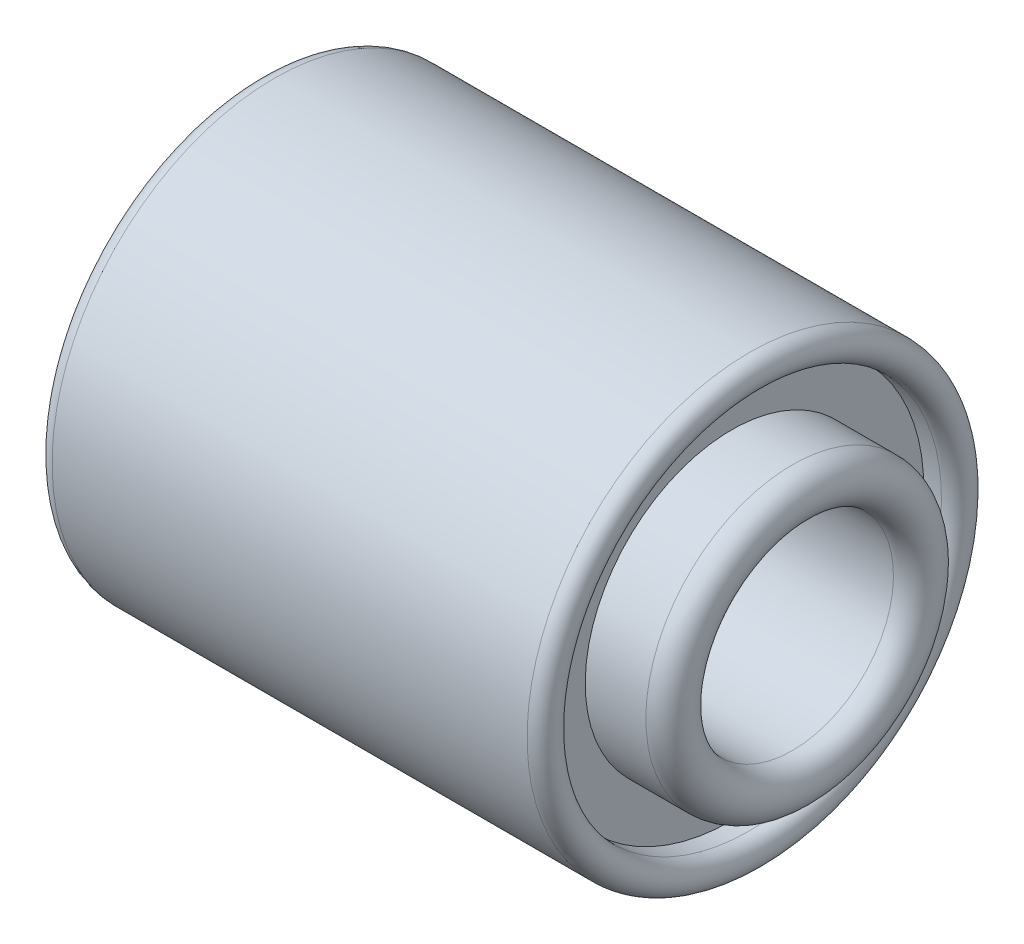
ISO-10303-21;
HEADER;
FILE_DESCRIPTION(('STEP AP214'),'2;1');
FILE_NAME('part.step','',(''),(''),'','','');
FILE_SCHEMA(('AUTOMOTIVE_DESIGN { 1 0 10303 214 1 1 1 1 }'));
ENDSEC;
DATA;
#1=APPLICATION_CONTEXT('core data for automotive mechanical design processes');
#2=APPLICATION_PROTOCOL_DEFINITION('international standard','automotive_design',2000,#1);
#3=PRODUCT_CONTEXT('',#1,'mechanical');
#4=PRODUCT('Part','Part','',(#3));
#5=PRODUCT_RELATED_PRODUCT_CATEGORY('part','',(#4));
#6=PRODUCT_DEFINITION_FORMATION('','',#4);
#7=PRODUCT_DEFINITION_CONTEXT('part definition',#1,'design');
#8=PRODUCT_DEFINITION('design','',#6,#7);
#9=PRODUCT_DEFINITION_SHAPE('','',#8);
#10=(LENGTH_UNIT() NAMED_UNIT(*) SI_UNIT(.MILLI.,.METRE.));
#11=(NAMED_UNIT(*) PLANE_ANGLE_UNIT() SI_UNIT($,.RADIAN.));
#12=(NAMED_UNIT(*) SI_UNIT($,.STERADIAN.) SOLID_ANGLE_UNIT());
#13=UNCERTAINTY_MEASURE_WITH_UNIT(LENGTH_MEASURE(1.E-05),#10,'distance_accuracy_value','');
#14=(GEOMETRIC_REPRESENTATION_CONTEXT(3) GLOBAL_UNCERTAINTY_ASSIGNED_CONTEXT((#13)) GLOBAL_UNIT_ASSIGNED_CONTEXT((#10,
#11,#12)) REPRESENTATION_CONTEXT('',''));
#15=CARTESIAN_POINT('',(0.,0.,0.));
#16=DIRECTION('',(0.,0.,1.));
#17=DIRECTION('',(1.,0.,0.));
#18=AXIS2_PLACEMENT_3D('',#15,#16,#17);
#19=CARTESIAN_POINT('',(-13.875,0.,0.));
#20=DIRECTION('',(-1.,0.,0.));
#21=DIRECTION('',(0.,-1.,0.));
#22=AXIS2_PLACEMENT_3D('',#19,#20,#21);
#23=TOROIDAL_SURFACE('',#22,6.125,1.125);
#24=CARTESIAN_POINT('',(-13.875,0.,0.));
#25=DIRECTION('',(-1.,0.,0.));
#26=DIRECTION('',(0.,-1.,0.));
#27=AXIS2_PLACEMENT_3D('',#24,#25,#26);
#28=CIRCLE('',#27,5.);
#29=CARTESIAN_POINT('',(-13.875,-4.99999999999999,0.));
#30=VERTEX_POINT('',#29);
#31=EDGE_CURVE('E10',#30,#30,#28,.T.);
#32=ORIENTED_EDGE('',*,*,#31,.F.);
#33=EDGE_LOOP('',(#32));
#34=FACE_BOUND('',#33,.T.);
#35=CARTESIAN_POINT('',(-13.875,0.,0.));
#36=DIRECTION('',(-1.,0.,0.));
#37=DIRECTION('',(0.,-1.,0.));
#38=AXIS2_PLACEMENT_3D('',#35,#36,#37);
#39=CIRCLE('',#38,7.25);
#40=CARTESIAN_POINT('',(-13.875,-7.24999999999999,0.));
#41=VERTEX_POINT('',#40);
#42=EDGE_CURVE('E66',#41,#41,#39,.T.);
#43=ORIENTED_EDGE('',*,*,#42,.T.);
#44=EDGE_LOOP('',(#43));
#45=FACE_BOUND('',#44,.T.);
#46=ADVANCED_FACE('F26',(#34,#45),#23,.T.);
#47=CARTESIAN_POINT('',(-35.5306358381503,0.,0.));
#48=DIRECTION('',(-1.,0.,0.));
#49=DIRECTION('',(0.,-1.,0.));
#50=AXIS2_PLACEMENT_3D('',#47,#48,#49);
#51=CYLINDRICAL_SURFACE('',#50,4.99999999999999);
#52=CARTESIAN_POINT('',(13.875,0.,0.));
#53=DIRECTION('',(-1.,0.,0.));
#54=DIRECTION('',(0.,-1.,0.));
#55=AXIS2_PLACEMENT_3D('',#52,#53,#54);
#56=CIRCLE('',#55,4.99999999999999);
#57=CARTESIAN_POINT('',(13.875,-4.99999999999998,0.));
#58=VERTEX_POINT('',#57);
#59=EDGE_CURVE('E32',#58,#58,#56,.T.);
#60=ORIENTED_EDGE('',*,*,#59,.F.);
#61=EDGE_LOOP('',(#60));
#62=FACE_BOUND('',#61,.T.);
#63=ORIENTED_EDGE('',*,*,#31,.T.);
#64=EDGE_LOOP('',(#63));
#65=FACE_BOUND('',#64,.T.);
#66=ADVANCED_FACE('F127',(#62,#65),#51,.F.);
#67=CARTESIAN_POINT('',(13.875,0.,0.));
#68=DIRECTION('',(-1.,0.,0.));
#69=DIRECTION('',(0.,-1.,0.));
#70=AXIS2_PLACEMENT_3D('',#67,#68,#69);
#71=TOROIDAL_SURFACE('',#70,6.12499999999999,1.125);
#72=CARTESIAN_POINT('',(13.875,0.,0.));
#73=DIRECTION('',(-1.,0.,0.));
#74=DIRECTION('',(0.,-1.,0.));
#75=AXIS2_PLACEMENT_3D('',#72,#73,#74);
#76=CIRCLE('',#75,7.24999999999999);
#77=CARTESIAN_POINT('',(13.875,-7.24999999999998,0.));
#78=VERTEX_POINT('',#77);
#79=EDGE_CURVE('E36',#78,#78,#76,.T.);
#80=ORIENTED_EDGE('',*,*,#79,.F.);
#81=EDGE_LOOP('',(#80));
#82=FACE_BOUND('',#81,.T.);
#83=ORIENTED_EDGE('',*,*,#59,.T.);
#84=EDGE_LOOP('',(#83));
#85=FACE_BOUND('',#84,.T.);
#86=ADVANCED_FACE('F122',(#82,#85),#71,.T.);
#87=CARTESIAN_POINT('',(-35.5306358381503,0.,0.));
#88=DIRECTION('',(-1.,0.,0.));
#89=DIRECTION('',(0.,-1.,0.));
#90=AXIS2_PLACEMENT_3D('',#87,#88,#89);
#91=CYLINDRICAL_SURFACE('',#90,7.24999999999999);
#92=CARTESIAN_POINT('',(10.875,0.,0.));
#93=DIRECTION('',(-1.,0.,0.));
#94=DIRECTION('',(0.,-1.,0.));
#95=AXIS2_PLACEMENT_3D('',#92,#93,#94);
#96=CIRCLE('',#95,7.24999999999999);
#97=CARTESIAN_POINT('',(10.875,-7.24999999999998,0.));
#98=VERTEX_POINT('',#97);
#99=EDGE_CURVE('E40',#98,#98,#96,.T.);
#100=ORIENTED_EDGE('',*,*,#99,.F.);
#101=EDGE_LOOP('',(#100));
#102=FACE_BOUND('',#101,.T.);
#103=ORIENTED_EDGE('',*,*,#79,.T.);
#104=EDGE_LOOP('',(#103));
#105=FACE_BOUND('',#104,.T.);
#106=ADVANCED_FACE('F116',(#102,#105),#91,.T.);
#107=CARTESIAN_POINT('',(10.875,7.25,0.));
#108=DIRECTION('',(-1.,0.,0.));
#109=DIRECTION('',(0.,-1.,0.));
#110=AXIS2_PLACEMENT_3D('',#107,#108,#109);
#111=PLANE('',#110);
#112=CARTESIAN_POINT('',(10.875,0.,0.));
#113=DIRECTION('',(-1.,0.,0.));
#114=DIRECTION('',(0.,-1.,0.));
#115=AXIS2_PLACEMENT_3D('',#112,#113,#114);
#116=CIRCLE('',#115,9.49999999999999);
#117=CARTESIAN_POINT('',(10.875,-9.49999999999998,0.));
#118=VERTEX_POINT('',#117);
#119=EDGE_CURVE('E45',#118,#118,#116,.T.);
#120=ORIENTED_EDGE('',*,*,#119,.F.);
#121=EDGE_LOOP('',(#120));
#122=FACE_BOUND('',#121,.T.);
#123=ORIENTED_EDGE('',*,*,#99,.T.);
#124=EDGE_LOOP('',(#123));
#125=FACE_BOUND('',#124,.T.);
#126=ADVANCED_FACE('F110',(#122,#125),#111,.F.);
#127=CARTESIAN_POINT('',(-35.5306358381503,0.,0.));
#128=DIRECTION('',(-1.,0.,0.));
#129=DIRECTION('',(0.,-1.,0.));
#130=AXIS2_PLACEMENT_3D('',#127,#128,#129);
#131=CYLINDRICAL_SURFACE('',#130,9.49999999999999);
#132=CARTESIAN_POINT('',(11.75,0.,0.));
#133=DIRECTION('',(-1.,0.,0.));
#134=DIRECTION('',(0.,-1.,0.));
#135=AXIS2_PLACEMENT_3D('',#132,#133,#134);
#136=CIRCLE('',#135,9.49999999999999);
#137=CARTESIAN_POINT('',(11.75,-9.49999999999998,0.));
#138=VERTEX_POINT('',#137);
#139=EDGE_CURVE('E48',#138,#138,#136,.T.);
#140=ORIENTED_EDGE('',*,*,#139,.F.);
#141=EDGE_LOOP('',(#140));
#142=FACE_BOUND('',#141,.T.);
#143=ORIENTED_EDGE('',*,*,#119,.T.);
#144=EDGE_LOOP('',(#143));
#145=FACE_BOUND('',#144,.T.);
#146=ADVANCED_FACE('F104',(#142,#145),#131,.F.);
#147=CARTESIAN_POINT('',(11.75,0.,0.));
#148=DIRECTION('',(-1.,0.,0.));
#149=DIRECTION('',(0.,-1.,0.));
#150=AXIS2_PLACEMENT_3D('',#147,#148,#149);
#151=TOROIDAL_SURFACE('',#150,10.25,0.750000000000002);
#152=CARTESIAN_POINT('',(11.75,0.,0.));
#153=DIRECTION('',(-1.,0.,0.));
#154=DIRECTION('',(0.,-1.,0.));
#155=AXIS2_PLACEMENT_3D('',#152,#153,#154);
#156=CIRCLE('',#155,11.);
#157=CARTESIAN_POINT('',(11.75,-11.,0.));
#158=VERTEX_POINT('',#157);
#159=EDGE_CURVE('E51',#158,#158,#156,.T.);
#160=ORIENTED_EDGE('',*,*,#159,.F.);
#161=EDGE_LOOP('',(#160));
#162=FACE_BOUND('',#161,.T.);
#163=ORIENTED_EDGE('',*,*,#139,.T.);
#164=EDGE_LOOP('',(#163));
#165=FACE_BOUND('',#164,.T.);
#166=ADVANCED_FACE('F98',(#162,#165),#151,.T.);
#167=CARTESIAN_POINT('',(-35.5306358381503,0.,0.));
#168=DIRECTION('',(-1.,0.,0.));
#169=DIRECTION('',(0.,-1.,0.));
#170=AXIS2_PLACEMENT_3D('',#167,#168,#169);
#171=CYLINDRICAL_SURFACE('',#170,11.);
#172=CARTESIAN_POINT('',(-11.75,0.,0.));
#173=DIRECTION('',(-1.,0.,0.));
#174=DIRECTION('',(0.,-1.,0.));
#175=AXIS2_PLACEMENT_3D('',#172,#173,#174);
#176=CIRCLE('',#175,11.);
#177=CARTESIAN_POINT('',(-11.75,-11.,0.));
#178=VERTEX_POINT('',#177);
#179=EDGE_CURVE('E54',#178,#178,#176,.T.);
#180=ORIENTED_EDGE('',*,*,#179,.F.);
#181=EDGE_LOOP('',(#180));
#182=FACE_BOUND('',#181,.T.);
#183=ORIENTED_EDGE('',*,*,#159,.T.);
#184=EDGE_LOOP('',(#183));
#185=FACE_BOUND('',#184,.T.);
#186=ADVANCED_FACE('F92',(#182,#185),#171,.T.);
#187=CARTESIAN_POINT('',(-11.75,0.,0.));
#188=DIRECTION('',(-1.,0.,0.));
#189=DIRECTION('',(0.,-1.,0.));
#190=AXIS2_PLACEMENT_3D('',#187,#188,#189);
#191=TOROIDAL_SURFACE('',#190,10.25,0.750000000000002);
#192=CARTESIAN_POINT('',(-11.75,0.,0.));
#193=DIRECTION('',(-1.,0.,0.));
#194=DIRECTION('',(0.,-1.,0.));
#195=AXIS2_PLACEMENT_3D('',#192,#193,#194);
#196=CIRCLE('',#195,9.49999999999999);
#197=CARTESIAN_POINT('',(-11.75,-9.49999999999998,0.));
#198=VERTEX_POINT('',#197);
#199=EDGE_CURVE('E57',#198,#198,#196,.T.);
#200=ORIENTED_EDGE('',*,*,#199,.F.);
#201=EDGE_LOOP('',(#200));
#202=FACE_BOUND('',#201,.T.);
#203=ORIENTED_EDGE('',*,*,#179,.T.);
#204=EDGE_LOOP('',(#203));
#205=FACE_BOUND('',#204,.T.);
#206=ADVANCED_FACE('F86',(#202,#205),#191,.T.);
#207=CARTESIAN_POINT('',(-35.5306358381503,0.,0.));
#208=DIRECTION('',(-1.,0.,0.));
#209=DIRECTION('',(0.,-1.,0.));
#210=AXIS2_PLACEMENT_3D('',#207,#208,#209);
#211=CYLINDRICAL_SURFACE('',#210,9.49999999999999);
#212=CARTESIAN_POINT('',(-10.875,0.,0.));
#213=DIRECTION('',(-1.,0.,0.));
#214=DIRECTION('',(0.,-1.,0.));
#215=AXIS2_PLACEMENT_3D('',#212,#213,#214);
#216=CIRCLE('',#215,9.49999999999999);
#217=CARTESIAN_POINT('',(-10.875,-9.49999999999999,0.));
#218=VERTEX_POINT('',#217);
#219=EDGE_CURVE('E60',#218,#218,#216,.T.);
#220=ORIENTED_EDGE('',*,*,#219,.F.);
#221=EDGE_LOOP('',(#220));
#222=FACE_BOUND('',#221,.T.);
#223=ORIENTED_EDGE('',*,*,#199,.T.);
#224=EDGE_LOOP('',(#223));
#225=FACE_BOUND('',#224,.T.);
#226=ADVANCED_FACE('F80',(#222,#225),#211,.F.);
#227=CARTESIAN_POINT('',(-10.875,7.25,0.));
#228=DIRECTION('',(1.,0.,0.));
#229=DIRECTION('',(0.,1.,0.));
#230=AXIS2_PLACEMENT_3D('',#227,#228,#229);
#231=PLANE('',#230);
#232=CARTESIAN_POINT('',(-10.875,0.,0.));
#233=DIRECTION('',(-1.,0.,0.));
#234=DIRECTION('',(0.,-1.,0.));
#235=AXIS2_PLACEMENT_3D('',#232,#233,#234);
#236=CIRCLE('',#235,7.25);
#237=CARTESIAN_POINT('',(-10.875,-7.24999999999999,0.));
#238=VERTEX_POINT('',#237);
#239=EDGE_CURVE('E63',#238,#238,#236,.T.);
#240=ORIENTED_EDGE('',*,*,#239,.F.);
#241=EDGE_LOOP('',(#240));
#242=FACE_BOUND('',#241,.T.);
#243=ORIENTED_EDGE('',*,*,#219,.T.);
#244=EDGE_LOOP('',(#243));
#245=FACE_BOUND('',#244,.T.);
#246=ADVANCED_FACE('F74',(#242,#245),#231,.F.);
#247=CARTESIAN_POINT('',(-35.5306358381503,0.,0.));
#248=DIRECTION('',(-1.,0.,0.));
#249=DIRECTION('',(0.,-1.,0.));
#250=AXIS2_PLACEMENT_3D('',#247,#248,#249);
#251=CYLINDRICAL_SURFACE('',#250,7.25);
#252=ORIENTED_EDGE('',*,*,#42,.F.);
#253=EDGE_LOOP('',(#252));
#254=FACE_BOUND('',#253,.T.);
#255=ORIENTED_EDGE('',*,*,#239,.T.);
#256=EDGE_LOOP('',(#255));
#257=FACE_BOUND('',#256,.T.);
#258=ADVANCED_FACE('F71',(#254,#257),#251,.T.);
#259=CLOSED_SHELL('',(#46,#66,#86,#106,#126,#146,#166,#186,#206,#226,#246,#258));
#260=MANIFOLD_SOLID_BREP('B2',#259);
#261=ADVANCED_BREP_SHAPE_REPRESENTATION('',(#18,#260),#14);
#262=SHAPE_DEFINITION_REPRESENTATION(#9,#261);
ENDSEC;
END-ISO-10303-21;
